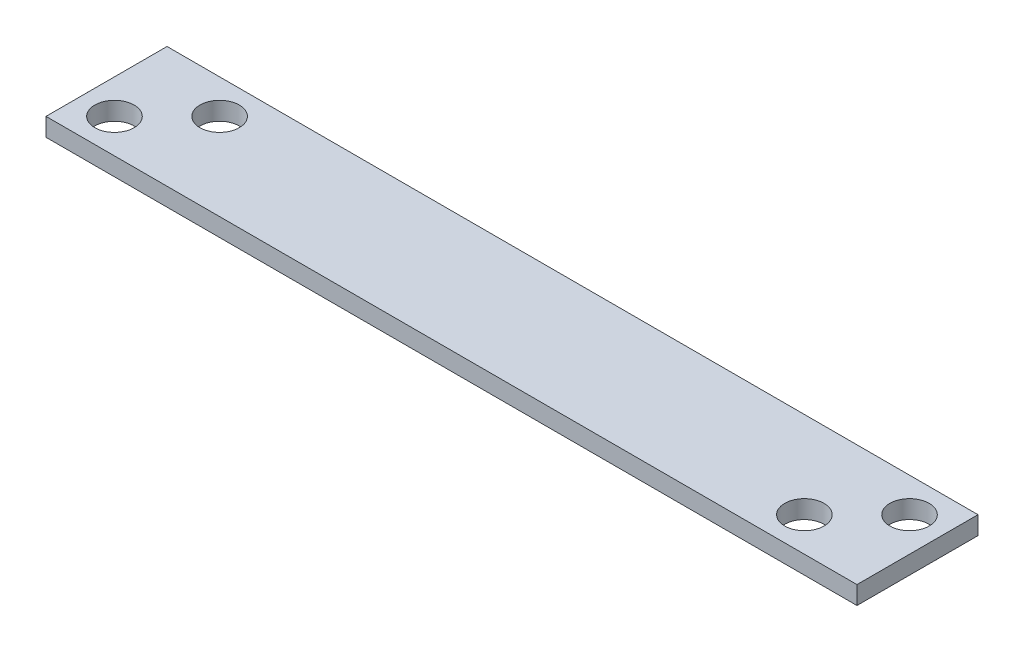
ISO-10303-21;
HEADER;
FILE_DESCRIPTION(('STEP AP214'),'2;1');
FILE_NAME('part.step','',(''),(''),'','','');
FILE_SCHEMA(('AUTOMOTIVE_DESIGN { 1 0 10303 214 1 1 1 1 }'));
ENDSEC;
DATA;
#1=APPLICATION_CONTEXT('core data for automotive mechanical design processes');
#2=APPLICATION_PROTOCOL_DEFINITION('international standard','automotive_design',2000,#1);
#3=PRODUCT_CONTEXT('',#1,'mechanical');
#4=PRODUCT('Part','Part','',(#3));
#5=PRODUCT_RELATED_PRODUCT_CATEGORY('part','',(#4));
#6=PRODUCT_DEFINITION_FORMATION('','',#4);
#7=PRODUCT_DEFINITION_CONTEXT('part definition',#1,'design');
#8=PRODUCT_DEFINITION('design','',#6,#7);
#9=PRODUCT_DEFINITION_SHAPE('','',#8);
#10=(LENGTH_UNIT() NAMED_UNIT(*) SI_UNIT(.MILLI.,.METRE.));
#11=(NAMED_UNIT(*) PLANE_ANGLE_UNIT() SI_UNIT($,.RADIAN.));
#12=(NAMED_UNIT(*) SI_UNIT($,.STERADIAN.) SOLID_ANGLE_UNIT());
#13=UNCERTAINTY_MEASURE_WITH_UNIT(LENGTH_MEASURE(1.E-05),#10,'distance_accuracy_value','');
#14=(GEOMETRIC_REPRESENTATION_CONTEXT(3) GLOBAL_UNCERTAINTY_ASSIGNED_CONTEXT((#13)) GLOBAL_UNIT_ASSIGNED_CONTEXT((#10,
#11,#12)) REPRESENTATION_CONTEXT('',''));
#15=CARTESIAN_POINT('',(0.,0.,0.));
#16=DIRECTION('',(0.,0.,1.));
#17=DIRECTION('',(1.,0.,0.));
#18=AXIS2_PLACEMENT_3D('',#15,#16,#17);
#19=CARTESIAN_POINT('',(0.,3.,-20.));
#20=DIRECTION('',(0.,-1.,0.));
#21=DIRECTION('',(0.,0.,-1.));
#22=AXIS2_PLACEMENT_3D('',#19,#20,#21);
#23=PLANE('',#22);
#24=CARTESIAN_POINT('',(14.3431457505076,3.,-14.3431457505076));
#25=DIRECTION('',(0.,1.,0.));
#26=DIRECTION('',(0.,0.,1.));
#27=AXIS2_PLACEMENT_3D('',#24,#25,#26);
#28=CIRCLE('',#27,3.25);
#29=CARTESIAN_POINT('',(14.3431457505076,3.,-11.0931457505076));
#30=VERTEX_POINT('',#29);
#31=EDGE_CURVE('E119',#30,#30,#28,.T.);
#32=ORIENTED_EDGE('',*,*,#31,.F.);
#33=EDGE_LOOP('',(#32));
#34=FACE_BOUND('',#33,.T.);
#35=CARTESIAN_POINT('',(128.343145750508,3.,-14.3431457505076));
#36=DIRECTION('',(0.,1.,0.));
#37=DIRECTION('',(0.,0.,1.));
#38=AXIS2_PLACEMENT_3D('',#35,#36,#37);
#39=CIRCLE('',#38,3.25000000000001);
#40=CARTESIAN_POINT('',(128.343145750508,3.,-11.0931457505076));
#41=VERTEX_POINT('',#40);
#42=EDGE_CURVE('E98',#41,#41,#39,.T.);
#43=ORIENTED_EDGE('',*,*,#42,.F.);
#44=EDGE_LOOP('',(#43));
#45=FACE_BOUND('',#44,.T.);
#46=DIRECTION('',(0.,0.,1.));
#47=VECTOR('',#46,1.);
#48=CARTESIAN_POINT('',(0.,3.,0.));
#49=LINE('',#48,#47);
#50=CARTESIAN_POINT('',(0.,3.,-20.));
#51=VERTEX_POINT('',#50);
#52=CARTESIAN_POINT('',(0.,3.,0.));
#53=VERTEX_POINT('',#52);
#54=EDGE_CURVE('E83',#51,#53,#49,.T.);
#55=ORIENTED_EDGE('',*,*,#54,.T.);
#56=DIRECTION('',(1.,0.,0.));
#57=VECTOR('',#56,1.);
#58=CARTESIAN_POINT('',(0.,3.,0.));
#59=LINE('',#58,#57);
#60=CARTESIAN_POINT('',(134.,3.,0.));
#61=VERTEX_POINT('',#60);
#62=EDGE_CURVE('E78',#53,#61,#59,.T.);
#63=ORIENTED_EDGE('',*,*,#62,.T.);
#64=DIRECTION('',(0.,0.,-1.));
#65=VECTOR('',#64,1.);
#66=CARTESIAN_POINT('',(134.,3.,0.));
#67=LINE('',#66,#65);
#68=CARTESIAN_POINT('',(134.,3.,-20.));
#69=VERTEX_POINT('',#68);
#70=EDGE_CURVE('E81',#61,#69,#67,.T.);
#71=ORIENTED_EDGE('',*,*,#70,.T.);
#72=DIRECTION('',(-1.,0.,0.));
#73=VECTOR('',#72,1.);
#74=CARTESIAN_POINT('',(0.,3.,-20.));
#75=LINE('',#74,#73);
#76=EDGE_CURVE('E48',#69,#51,#75,.T.);
#77=ORIENTED_EDGE('',*,*,#76,.T.);
#78=EDGE_LOOP('',(#55,#63,#71,#77));
#79=FACE_BOUND('',#78,.T.);
#80=CARTESIAN_POINT('',(119.656854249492,3.,-5.65685424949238));
#81=DIRECTION('',(0.,1.,0.));
#82=DIRECTION('',(0.,0.,1.));
#83=AXIS2_PLACEMENT_3D('',#80,#81,#82);
#84=CIRCLE('',#83,3.25000000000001);
#85=CARTESIAN_POINT('',(119.656854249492,3.,-2.40685424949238));
#86=VERTEX_POINT('',#85);
#87=EDGE_CURVE('E113',#86,#86,#84,.T.);
#88=ORIENTED_EDGE('',*,*,#87,.F.);
#89=EDGE_LOOP('',(#88));
#90=FACE_BOUND('',#89,.T.);
#91=CARTESIAN_POINT('',(5.65685424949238,3.,-5.65685424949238));
#92=DIRECTION('',(0.,1.,0.));
#93=DIRECTION('',(0.,0.,1.));
#94=AXIS2_PLACEMENT_3D('',#91,#92,#93);
#95=CIRCLE('',#94,3.25);
#96=CARTESIAN_POINT('',(5.65685424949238,3.,-2.40685424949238));
#97=VERTEX_POINT('',#96);
#98=EDGE_CURVE('E125',#97,#97,#95,.T.);
#99=ORIENTED_EDGE('',*,*,#98,.F.);
#100=EDGE_LOOP('',(#99));
#101=FACE_BOUND('',#100,.T.);
#102=ADVANCED_FACE('F31',(#34,#45,#79,#90,#101),#23,.F.);
#103=CARTESIAN_POINT('',(0.,0.,-20.));
#104=DIRECTION('',(0.,-1.,0.));
#105=DIRECTION('',(0.,0.,-1.));
#106=AXIS2_PLACEMENT_3D('',#103,#104,#105);
#107=PLANE('',#106);
#108=CARTESIAN_POINT('',(14.3431457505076,0.,-14.3431457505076));
#109=DIRECTION('',(0.,1.,0.));
#110=DIRECTION('',(0.,0.,1.));
#111=AXIS2_PLACEMENT_3D('',#108,#109,#110);
#112=CIRCLE('',#111,3.25);
#113=CARTESIAN_POINT('',(14.3431457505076,0.,-11.0931457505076));
#114=VERTEX_POINT('',#113);
#115=EDGE_CURVE('E122',#114,#114,#112,.T.);
#116=ORIENTED_EDGE('',*,*,#115,.T.);
#117=EDGE_LOOP('',(#116));
#118=FACE_BOUND('',#117,.T.);
#119=CARTESIAN_POINT('',(128.343145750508,0.,-14.3431457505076));
#120=DIRECTION('',(0.,1.,0.));
#121=DIRECTION('',(0.,0.,1.));
#122=AXIS2_PLACEMENT_3D('',#119,#120,#121);
#123=CIRCLE('',#122,3.25000000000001);
#124=CARTESIAN_POINT('',(128.343145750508,0.,-11.0931457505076));
#125=VERTEX_POINT('',#124);
#126=EDGE_CURVE('E110',#125,#125,#123,.T.);
#127=ORIENTED_EDGE('',*,*,#126,.T.);
#128=EDGE_LOOP('',(#127));
#129=FACE_BOUND('',#128,.T.);
#130=DIRECTION('',(0.,0.,1.));
#131=VECTOR('',#130,1.);
#132=CARTESIAN_POINT('',(0.,0.,0.));
#133=LINE('',#132,#131);
#134=CARTESIAN_POINT('',(0.,0.,-20.));
#135=VERTEX_POINT('',#134);
#136=CARTESIAN_POINT('',(0.,0.,0.));
#137=VERTEX_POINT('',#136);
#138=EDGE_CURVE('E95',#135,#137,#133,.T.);
#139=ORIENTED_EDGE('',*,*,#138,.F.);
#140=DIRECTION('',(-1.,0.,0.));
#141=VECTOR('',#140,1.);
#142=CARTESIAN_POINT('',(0.,0.,-20.));
#143=LINE('',#142,#141);
#144=CARTESIAN_POINT('',(134.,0.,-20.));
#145=VERTEX_POINT('',#144);
#146=EDGE_CURVE('E71',#145,#135,#143,.T.);
#147=ORIENTED_EDGE('',*,*,#146,.F.);
#148=DIRECTION('',(0.,0.,-1.));
#149=VECTOR('',#148,1.);
#150=CARTESIAN_POINT('',(134.,0.,0.));
#151=LINE('',#150,#149);
#152=CARTESIAN_POINT('',(134.,0.,0.));
#153=VERTEX_POINT('',#152);
#154=EDGE_CURVE('E65',#153,#145,#151,.T.);
#155=ORIENTED_EDGE('',*,*,#154,.F.);
#156=DIRECTION('',(1.,0.,0.));
#157=VECTOR('',#156,1.);
#158=CARTESIAN_POINT('',(0.,0.,0.));
#159=LINE('',#158,#157);
#160=EDGE_CURVE('E87',#137,#153,#159,.T.);
#161=ORIENTED_EDGE('',*,*,#160,.F.);
#162=EDGE_LOOP('',(#139,#147,#155,#161));
#163=FACE_BOUND('',#162,.T.);
#164=CARTESIAN_POINT('',(119.656854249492,0.,-5.65685424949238));
#165=DIRECTION('',(0.,1.,0.));
#166=DIRECTION('',(0.,0.,1.));
#167=AXIS2_PLACEMENT_3D('',#164,#165,#166);
#168=CIRCLE('',#167,3.25000000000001);
#169=CARTESIAN_POINT('',(119.656854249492,0.,-2.40685424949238));
#170=VERTEX_POINT('',#169);
#171=EDGE_CURVE('E116',#170,#170,#168,.T.);
#172=ORIENTED_EDGE('',*,*,#171,.T.);
#173=EDGE_LOOP('',(#172));
#174=FACE_BOUND('',#173,.T.);
#175=CARTESIAN_POINT('',(5.65685424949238,0.,-5.65685424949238));
#176=DIRECTION('',(0.,1.,0.));
#177=DIRECTION('',(0.,0.,1.));
#178=AXIS2_PLACEMENT_3D('',#175,#176,#177);
#179=CIRCLE('',#178,3.25);
#180=CARTESIAN_POINT('',(5.65685424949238,0.,-2.40685424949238));
#181=VERTEX_POINT('',#180);
#182=EDGE_CURVE('E128',#181,#181,#179,.T.);
#183=ORIENTED_EDGE('',*,*,#182,.T.);
#184=EDGE_LOOP('',(#183));
#185=FACE_BOUND('',#184,.T.);
#186=ADVANCED_FACE('F106',(#118,#129,#163,#174,#185),#107,.T.);
#187=CARTESIAN_POINT('',(0.,3.,0.));
#188=DIRECTION('',(1.,0.,0.));
#189=DIRECTION('',(0.,0.,-1.));
#190=AXIS2_PLACEMENT_3D('',#187,#188,#189);
#191=PLANE('',#190);
#192=ORIENTED_EDGE('',*,*,#138,.T.);
#193=DIRECTION('',(0.,-1.,0.));
#194=VECTOR('',#193,1.);
#195=CARTESIAN_POINT('',(0.,3.,0.));
#196=LINE('',#195,#194);
#197=EDGE_CURVE('E11',#53,#137,#196,.T.);
#198=ORIENTED_EDGE('',*,*,#197,.F.);
#199=ORIENTED_EDGE('',*,*,#54,.F.);
#200=DIRECTION('',(0.,-1.,0.));
#201=VECTOR('',#200,1.);
#202=CARTESIAN_POINT('',(0.,3.,-20.));
#203=LINE('',#202,#201);
#204=EDGE_CURVE('E91',#51,#135,#203,.T.);
#205=ORIENTED_EDGE('',*,*,#204,.T.);
#206=EDGE_LOOP('',(#192,#198,#199,#205));
#207=FACE_BOUND('',#206,.T.);
#208=ADVANCED_FACE('F33',(#207),#191,.F.);
#209=CARTESIAN_POINT('',(0.,3.,0.));
#210=DIRECTION('',(0.,0.,-1.));
#211=DIRECTION('',(-1.,0.,0.));
#212=AXIS2_PLACEMENT_3D('',#209,#210,#211);
#213=PLANE('',#212);
#214=ORIENTED_EDGE('',*,*,#160,.T.);
#215=DIRECTION('',(0.,-1.,0.));
#216=VECTOR('',#215,1.);
#217=CARTESIAN_POINT('',(134.,3.,0.));
#218=LINE('',#217,#216);
#219=EDGE_CURVE('E40',#61,#153,#218,.T.);
#220=ORIENTED_EDGE('',*,*,#219,.F.);
#221=ORIENTED_EDGE('',*,*,#62,.F.);
#222=ORIENTED_EDGE('',*,*,#197,.T.);
#223=EDGE_LOOP('',(#214,#220,#221,#222));
#224=FACE_BOUND('',#223,.T.);
#225=ADVANCED_FACE('F86',(#224),#213,.F.);
#226=CARTESIAN_POINT('',(134.,3.,0.));
#227=DIRECTION('',(-1.,0.,0.));
#228=DIRECTION('',(0.,0.,1.));
#229=AXIS2_PLACEMENT_3D('',#226,#227,#228);
#230=PLANE('',#229);
#231=ORIENTED_EDGE('',*,*,#154,.T.);
#232=DIRECTION('',(0.,-1.,0.));
#233=VECTOR('',#232,1.);
#234=CARTESIAN_POINT('',(134.,3.,-20.));
#235=LINE('',#234,#233);
#236=EDGE_CURVE('E88',#69,#145,#235,.T.);
#237=ORIENTED_EDGE('',*,*,#236,.F.);
#238=ORIENTED_EDGE('',*,*,#70,.F.);
#239=ORIENTED_EDGE('',*,*,#219,.T.);
#240=EDGE_LOOP('',(#231,#237,#238,#239));
#241=FACE_BOUND('',#240,.T.);
#242=ADVANCED_FACE('F89',(#241),#230,.F.);
#243=CARTESIAN_POINT('',(0.,3.,-20.));
#244=DIRECTION('',(0.,0.,1.));
#245=DIRECTION('',(1.,0.,0.));
#246=AXIS2_PLACEMENT_3D('',#243,#244,#245);
#247=PLANE('',#246);
#248=ORIENTED_EDGE('',*,*,#146,.T.);
#249=ORIENTED_EDGE('',*,*,#204,.F.);
#250=ORIENTED_EDGE('',*,*,#76,.F.);
#251=ORIENTED_EDGE('',*,*,#236,.T.);
#252=EDGE_LOOP('',(#248,#249,#250,#251));
#253=FACE_BOUND('',#252,.T.);
#254=ADVANCED_FACE('F103',(#253),#247,.F.);
#255=CARTESIAN_POINT('',(128.343145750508,3.,-14.3431457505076));
#256=DIRECTION('',(0.,-1.,0.));
#257=DIRECTION('',(0.,0.,-1.));
#258=AXIS2_PLACEMENT_3D('',#255,#256,#257);
#259=CYLINDRICAL_SURFACE('',#258,3.25000000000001);
#260=ORIENTED_EDGE('',*,*,#42,.T.);
#261=EDGE_LOOP('',(#260));
#262=FACE_BOUND('',#261,.T.);
#263=ORIENTED_EDGE('',*,*,#126,.F.);
#264=EDGE_LOOP('',(#263));
#265=FACE_BOUND('',#264,.T.);
#266=ADVANCED_FACE('F148',(#262,#265),#259,.F.);
#267=CARTESIAN_POINT('',(119.656854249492,3.,-5.65685424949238));
#268=DIRECTION('',(0.,-1.,0.));
#269=DIRECTION('',(0.,0.,-1.));
#270=AXIS2_PLACEMENT_3D('',#267,#268,#269);
#271=CYLINDRICAL_SURFACE('',#270,3.25000000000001);
#272=ORIENTED_EDGE('',*,*,#87,.T.);
#273=EDGE_LOOP('',(#272));
#274=FACE_BOUND('',#273,.T.);
#275=ORIENTED_EDGE('',*,*,#171,.F.);
#276=EDGE_LOOP('',(#275));
#277=FACE_BOUND('',#276,.T.);
#278=ADVANCED_FACE('F194',(#274,#277),#271,.F.);
#279=CARTESIAN_POINT('',(14.3431457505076,3.,-14.3431457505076));
#280=DIRECTION('',(0.,-1.,0.));
#281=DIRECTION('',(0.,0.,-1.));
#282=AXIS2_PLACEMENT_3D('',#279,#280,#281);
#283=CYLINDRICAL_SURFACE('',#282,3.25);
#284=ORIENTED_EDGE('',*,*,#31,.T.);
#285=EDGE_LOOP('',(#284));
#286=FACE_BOUND('',#285,.T.);
#287=ORIENTED_EDGE('',*,*,#115,.F.);
#288=EDGE_LOOP('',(#287));
#289=FACE_BOUND('',#288,.T.);
#290=ADVANCED_FACE('F202',(#286,#289),#283,.F.);
#291=CARTESIAN_POINT('',(5.65685424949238,3.,-5.65685424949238));
#292=DIRECTION('',(0.,-1.,0.));
#293=DIRECTION('',(0.,0.,-1.));
#294=AXIS2_PLACEMENT_3D('',#291,#292,#293);
#295=CYLINDRICAL_SURFACE('',#294,3.25);
#296=ORIENTED_EDGE('',*,*,#98,.T.);
#297=EDGE_LOOP('',(#296));
#298=FACE_BOUND('',#297,.T.);
#299=ORIENTED_EDGE('',*,*,#182,.F.);
#300=EDGE_LOOP('',(#299));
#301=FACE_BOUND('',#300,.T.);
#302=ADVANCED_FACE('F134',(#298,#301),#295,.F.);
#303=CLOSED_SHELL('',(#102,#186,#208,#225,#242,#254,#266,#278,#290,#302));
#304=MANIFOLD_SOLID_BREP('B2',#303);
#305=ADVANCED_BREP_SHAPE_REPRESENTATION('',(#18,#304),#14);
#306=SHAPE_DEFINITION_REPRESENTATION(#9,#305);
ENDSEC;
END-ISO-10303-21;
